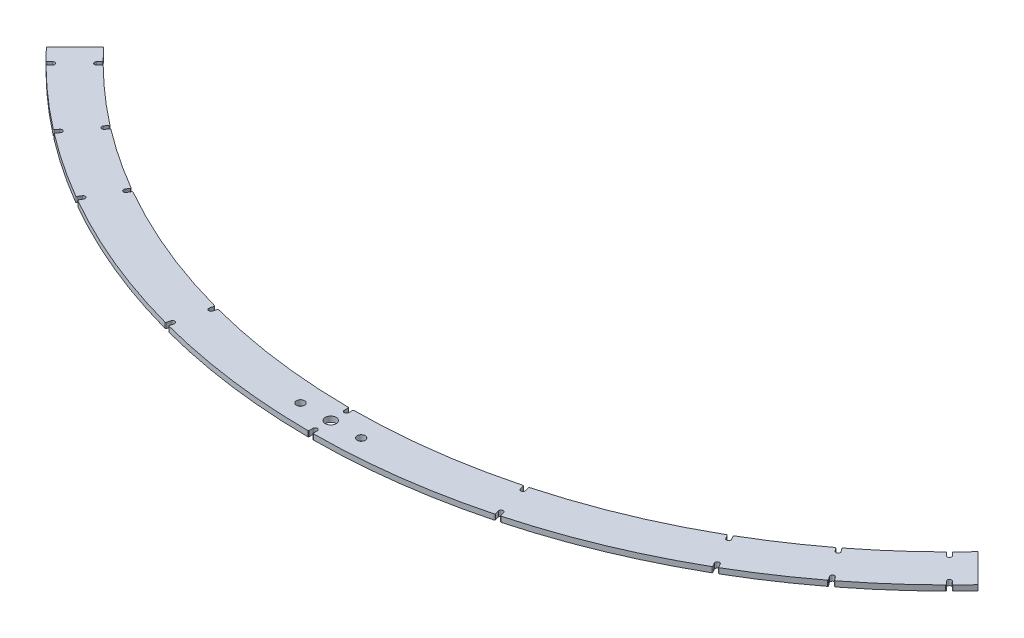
from build123d import *

# Parameters (mm, degrees)
SCHIZZO1_R                   = 4.05
SCHIZZO1_R_2                 = 3
ESTRUSIONE_ESTRUSIONE1_DEPTH = 4


with BuildPart() as part:
    # Schizzo1 → Estrusione-Estrusione1 (new body)
    with BuildSketch(Plane(origin=(0, 0, 0), x_dir=(1, 0, 0), z_dir=(0, 1, 0))):
        with BuildLine():
            Line((1373.599877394, 1371.109985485), (1394.824433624, 1392.334541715))
            ThreePointArc((1394.824433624, 1392.334541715), (1399.264442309, 1387.652479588), (1403.772036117, 1383.035447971))
            ThreePointArc((1403.772036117, 1383.035447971), (1403.916814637, 1382.682387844), (1403.770369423, 1382.330015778))
            Line((1403.770369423, 1382.330015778), (1401.714327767, 1380.273974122))
            ThreePointArc((1401.714327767, 1380.273974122), (1401.716249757, 1378.013154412), (1403.977069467, 1378.011232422))
            Line((1403.977069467, 1378.011232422), (1406.033111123, 1380.067274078))
            ThreePointArc((1406.033111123, 1380.067274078), (1406.385483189, 1380.213719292), (1406.738543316, 1380.068940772))
            ThreePointArc((1406.738543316, 1380.068940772), (1426.453714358, 1361.69091638), (1447.247858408, 1344.543224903))
            ThreePointArc((1447.247858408, 1344.543224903), (1447.437481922, 1344.212082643), (1447.338283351, 1343.843610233))
            Line((1447.338283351, 1343.843610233), (1445.568198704, 1341.536791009))
            ThreePointArc((1445.568198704, 1341.536791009), (1445.865200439, 1339.295563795), (1448.106929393, 1339.588754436))
            Line((1448.106929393, 1339.588754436), (1449.87701404, 1341.89557366))
            ThreePointArc((1449.87701404, 1341.89557366), (1450.207256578, 1342.086759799), (1450.576193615, 1341.989303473))
            ThreePointArc((1450.576193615, 1341.989303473), (1472.521512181, 1326.341851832), (1495.37598232, 1312.055041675))
            ThreePointArc((1495.37598232, 1312.055041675), (1495.607206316, 1311.751483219), (1495.556951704, 1311.373215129))
            Line((1495.556951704, 1311.373215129), (1494.103110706, 1308.855088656))
            ThreePointArc((1494.103110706, 1308.855088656), (1494.690110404, 1306.671801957), (1496.874391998, 1307.255088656))
            Line((1496.874391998, 1307.255088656), (1498.328232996, 1309.773215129))
            ThreePointArc((1498.328232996, 1309.773215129), (1498.630695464, 1310.005870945), (1499.009196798, 1309.957404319))
            ThreePointArc((1499.009196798, 1309.957404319), (1549.268989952, 1285.319470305), (1602.229680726, 1267.202079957))
            ThreePointArc((1602.229680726, 1267.202079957), (1602.531592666, 1266.968710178), (1602.580953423, 1266.590324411))
            Line((1602.580953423, 1266.590324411), (1601.828389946, 1263.781719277))
            ThreePointArc((1601.828389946, 1263.781719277), (1602.960464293, 1261.82475297), (1604.91935259, 1262.953498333))
            Line((1604.91935259, 1262.953498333), (1605.671916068, 1265.762103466))
            ThreePointArc((1605.671916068, 1265.762103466), (1605.903856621, 1266.065114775), (1606.28200492, 1266.116262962))
            ThreePointArc((1606.28200492, 1266.116262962), (1661.206003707, 1255.326037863), (1717.051228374, 1251.533218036))
            ThreePointArc((1717.051228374, 1251.533218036), (1717.403253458, 1251.385940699), (1717.548865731, 1251.033223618))
            Line((1717.548865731, 1251.033223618), (1717.548865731, 1248.125541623))
            ThreePointArc((1717.548865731, 1248.125541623), (1719.148865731, 1246.528259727), (1720.748865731, 1248.125541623))
            Line((1720.748865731, 1248.125541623), (1720.748865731, 1251.033223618))
            ThreePointArc((1720.748865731, 1251.033223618), (1720.894478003, 1251.3859407), (1721.246503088, 1251.533218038))
            ThreePointArc((1721.246503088, 1251.533218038), (1777.091727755, 1255.326037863), (1832.015726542, 1266.11626296))
            ThreePointArc((1832.015726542, 1266.11626296), (1832.393874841, 1266.065114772), (1832.625815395, 1265.762103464))
            Line((1832.625815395, 1265.762103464), (1833.378378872, 1262.95349833))
            ThreePointArc((1833.378378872, 1262.95349833), (1835.337267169, 1261.824752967), (1836.469341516, 1263.781719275))
            Line((1836.469341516, 1263.781719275), (1835.716778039, 1266.590324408))
            ThreePointArc((1835.716778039, 1266.590324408), (1835.766138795, 1266.968710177), (1836.068050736, 1267.202079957))
            ThreePointArc((1836.068050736, 1267.202079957), (1889.028741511, 1285.319470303), (1939.288534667, 1309.957404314))
            ThreePointArc((1939.288534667, 1309.957404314), (1939.667036, 1310.005870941), (1939.969498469, 1309.773215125))
            Line((1939.969498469, 1309.773215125), (1941.423339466, 1307.255088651))
            ThreePointArc((1941.423339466, 1307.255088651), (1943.60762106, 1306.671801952), (1944.194620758, 1308.855088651))
            Line((1944.194620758, 1308.855088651), (1942.740779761, 1311.373215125))
            ThreePointArc((1942.740779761, 1311.373215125), (1942.690525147, 1311.751483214), (1942.921749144, 1312.055041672))
            ThreePointArc((1942.921749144, 1312.055041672), (1965.776219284, 1326.341851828), (1987.72153785, 1341.989303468))
            ThreePointArc((1987.72153785, 1341.989303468), (1988.090474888, 1342.086759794), (1988.420717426, 1341.895573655))
            Line((1988.420717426, 1341.895573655), (1990.190802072, 1339.588754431))
            ThreePointArc((1990.190802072, 1339.588754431), (1992.434185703, 1339.293407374), (1992.729532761, 1341.536791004))
            Line((1992.729532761, 1341.536791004), (1990.959448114, 1343.843610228))
            ThreePointArc((1990.959448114, 1343.843610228), (1990.860249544, 1344.212082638), (1991.049873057, 1344.543224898))
            ThreePointArc((1991.049873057, 1344.543224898), (2011.844017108, 1361.690916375), (2031.559188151, 1380.068940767))
            ThreePointArc((2031.559188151, 1380.068940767), (2031.912248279, 1380.213719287), (2032.264620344, 1380.067274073))
            Line((2032.264620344, 1380.067274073), (2034.320662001, 1378.011232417))
            ThreePointArc((2034.320662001, 1378.011232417), (2036.5834037, 1378.011232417), (2036.5834037, 1380.273974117))
            Line((2036.5834037, 1380.273974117), (2034.527362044, 1382.330015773))
            ThreePointArc((2034.527362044, 1382.330015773), (2034.38091683, 1382.682387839), (2034.52569535, 1383.035447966))
            ThreePointArc((2034.52569535, 1383.035447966), (2039.033289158, 1387.652479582), (2043.473297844, 1392.334541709))
            Line((2043.473297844, 1392.334541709), (2064.697854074, 1371.109985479))
            ThreePointArc((2064.697854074, 1371.109985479), (2060.25169196, 1366.437158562), (2055.742345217, 1361.825275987))
            ThreePointArc((2055.742345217, 1361.825275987), (2055.388335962, 1361.677258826), (2055.033673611, 1361.823704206))
            Line((2055.033673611, 1361.823704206), (2052.984433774, 1363.872944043))
            ThreePointArc((2052.984433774, 1363.872944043), (2050.723614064, 1363.871022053), (2050.721692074, 1361.610202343))
            Line((2050.721692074, 1361.610202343), (2052.770931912, 1359.560962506))
            ThreePointArc((2052.770931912, 1359.560962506), (2052.917377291, 1359.206300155), (2052.76936013, 1358.8522909))
            ThreePointArc((2052.76936013, 1358.8522909), (2031.624391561, 1339.135722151), (2009.316528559, 1320.745180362))
            ThreePointArc((2009.316528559, 1320.745180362), (2008.946227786, 1320.644636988), (2008.613714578, 1320.836122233))
            Line((2008.613714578, 1320.836122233), (2006.849485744, 1323.135310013))
            ThreePointArc((2006.849485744, 1323.135310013), (2004.60775679, 1323.428500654), (2004.310755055, 1321.18727344))
            Line((2004.310755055, 1321.18727344), (2006.074983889, 1318.888085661))
            ThreePointArc((2006.074983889, 1318.888085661), (2006.173883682, 1318.517342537), (2005.980925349, 1318.185681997))
            ThreePointArc((2005.980925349, 1318.185681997), (1982.443326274, 1301.397763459), (1957.92586274, 1286.076315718))
            ThreePointArc((1957.92586274, 1286.076315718), (1957.545606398, 1286.024966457), (1957.240931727, 1286.258215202))
            Line((1957.240931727, 1286.258215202), (1955.791900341, 1288.768011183))
            ThreePointArc((1955.791900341, 1288.768011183), (1953.607618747, 1289.351297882), (1953.020619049, 1287.168011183))
            Line((1953.020619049, 1287.168011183), (1954.469650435, 1284.658215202))
            ThreePointArc((1954.469650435, 1284.658215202), (1954.519312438, 1284.277734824), (1954.284714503, 1283.974097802))
            ThreePointArc((1954.284714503, 1283.974097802), (1900.509244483, 1257.603084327), (1843.837122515, 1238.22520727))
            ThreePointArc((1843.837122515, 1238.22520727), (1843.456532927, 1238.274025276), (1843.22260901, 1238.57818187))
            Line((1843.22260901, 1238.57818187), (1842.472535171, 1241.377495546))
            ThreePointArc((1842.472535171, 1241.377495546), (1840.513646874, 1242.50624091), (1839.381572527, 1240.549274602))
            Line((1839.381572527, 1240.549274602), (1840.131646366, 1237.749960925))
            ThreePointArc((1840.131646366, 1237.749960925), (1840.08114061, 1237.36959163), (1839.775949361, 1237.137019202))
            ThreePointArc((1839.775949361, 1237.137019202), (1781.007513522, 1225.582692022), (1721.251083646, 1221.532924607))
            ThreePointArc((1721.251083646, 1221.532924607), (1720.896097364, 1221.678583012), (1720.748865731, 1222.032919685))
            Line((1720.748865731, 1222.032919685), (1720.748865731, 1224.930982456))
            ThreePointArc((1720.748865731, 1224.930982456), (1719.148865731, 1226.528264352), (1717.548865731, 1224.930982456))
            Line((1717.548865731, 1224.930982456), (1717.548865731, 1222.032919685))
            ThreePointArc((1717.548865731, 1222.032919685), (1717.401634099, 1221.678583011), (1717.046647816, 1221.532924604))
            ThreePointArc((1717.046647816, 1221.532924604), (1657.29021794, 1225.582692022), (1598.521782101, 1237.137019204))
            ThreePointArc((1598.521782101, 1237.137019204), (1598.216590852, 1237.369591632), (1598.166085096, 1237.749960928))
            Line((1598.166085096, 1237.749960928), (1598.916158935, 1240.549274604))
            ThreePointArc((1598.916158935, 1240.549274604), (1597.784084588, 1242.506240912), (1595.825196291, 1241.377495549))
            Line((1595.825196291, 1241.377495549), (1595.075122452, 1238.578181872))
            ThreePointArc((1595.075122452, 1238.578181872), (1594.841198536, 1238.274025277), (1594.460608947, 1238.225207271))
            ThreePointArc((1594.460608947, 1238.225207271), (1537.788486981, 1257.60308433), (1484.013016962, 1283.974097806))
            ThreePointArc((1484.013016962, 1283.974097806), (1483.778419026, 1284.277734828), (1483.828081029, 1284.658215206))
            Line((1483.828081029, 1284.658215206), (1485.277112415, 1287.168011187))
            ThreePointArc((1485.277112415, 1287.168011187), (1484.690112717, 1289.351297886), (1482.505831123, 1288.768011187))
            Line((1482.505831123, 1288.768011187), (1481.056799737, 1286.258215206))
            ThreePointArc((1481.056799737, 1286.258215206), (1480.752125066, 1286.02496646), (1480.371868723, 1286.076315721))
            ThreePointArc((1480.371868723, 1286.076315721), (1455.85440519, 1301.397763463), (1432.316806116, 1318.185682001))
            ThreePointArc((1432.316806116, 1318.185682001), (1432.123847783, 1318.517342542), (1432.222747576, 1318.888085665))
            Line((1432.222747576, 1318.888085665), (1433.98697641, 1321.187273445))
            ThreePointArc((1433.98697641, 1321.187273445), (1433.689974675, 1323.428500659), (1431.448245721, 1323.135310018))
            Line((1431.448245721, 1323.135310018), (1429.684016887, 1320.836122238))
            ThreePointArc((1429.684016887, 1320.836122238), (1429.351503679, 1320.644636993), (1428.981202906, 1320.745180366))
            ThreePointArc((1428.981202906, 1320.745180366), (1406.673339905, 1339.135722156), (1385.528371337, 1358.852290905))
            ThreePointArc((1385.528371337, 1358.852290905), (1385.380354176, 1359.20630016), (1385.526799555, 1359.560962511))
            Line((1385.526799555, 1359.560962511), (1387.576039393, 1361.610202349))
            ThreePointArc((1387.576039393, 1361.610202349), (1387.574117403, 1363.871022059), (1385.313297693, 1363.872944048))
            Line((1385.313297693, 1363.872944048), (1383.264057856, 1361.823704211))
            ThreePointArc((1383.264057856, 1361.823704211), (1382.909395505, 1361.677258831), (1382.55538625, 1361.825275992))
            ThreePointArc((1382.55538625, 1361.825275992), (1378.046039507, 1366.437158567), (1373.599877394, 1371.109985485))
        make_face()
        with Locations(Location((1719.148865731, 1236.528262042, 0), (0, 0, 270))):
            Circle(SCHIZZO1_R, mode=Mode.SUBTRACT)
        with Locations(Location((1696.648865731, 1236.528262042, 0), (0, 0, 270))):
            Circle(SCHIZZO1_R_2, mode=Mode.SUBTRACT)
        with Locations(Location((1741.648865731, 1236.528262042, 0), (0, 0, 270))):
            Circle(SCHIZZO1_R_2, mode=Mode.SUBTRACT)
    extrude(amount=ESTRUSIONE_ESTRUSIONE1_DEPTH)


solid = part.part
